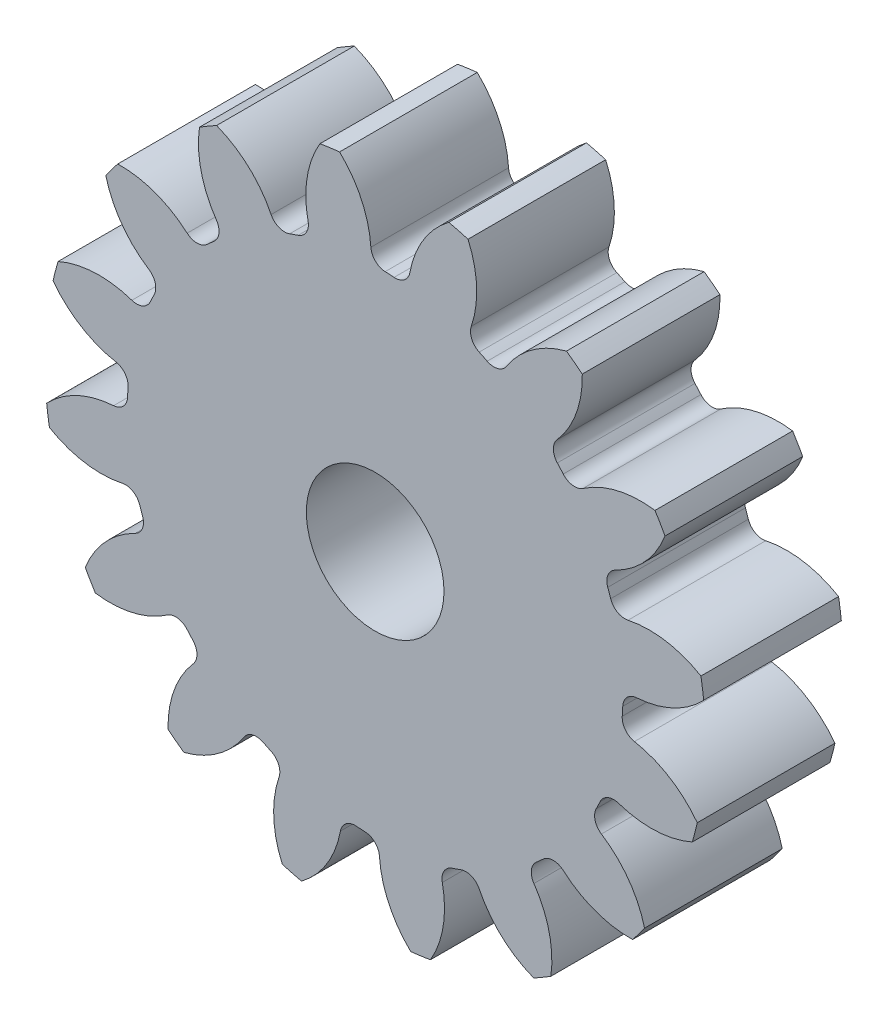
from build123d import *

# Parameters (mm, degrees)
SKETCH3_R         = 304.8
GEARBODY_DEPTH    = 127
TOOTHCUT_DEPTH    = 450.371872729
CIRPATTERN1_COUNT = 16
BOREDIA_R         = 63.5
BORE_DEPTH        = 12700


with BuildPart() as part:
    # Sketch3 → gearBody (new body)
    with BuildSketch(Plane.XY):
        Circle(SKETCH3_R)
    extrude(amount=GEARBODY_DEPTH)

    # Sketch2 → toothCut (cut, through all)
    with BuildSketch(Plane.XY):
        with BuildLine():
            ThreePointArc((227.933335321, -17.445763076), (228.210083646, -13.34607516), (228.413099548, -9.242075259))
            ThreePointArc((228.413099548, -9.242075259), (232.320415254, -0.172804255), (241.291317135, 3.955356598))
            ThreePointArc((241.291317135, 3.955356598), (276.053863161, 13.129673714), (304.8, 34.722781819))
            ThreePointArc((304.8, 34.722781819), (306.248181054, -17.9098626), (298.674779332, -70.014911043))
            ThreePointArc((298.674779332, -70.014911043), (272.641588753, -45.218223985), (239.185413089, -32.054371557))
            ThreePointArc((239.185413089, -32.054371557), (230.756861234, -26.908664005), (227.933335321, -17.445763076))
        make_face()
    toothcut = extrude(amount=TOOTHCUT_DEPTH, mode=Mode.SUBTRACT)

    # CirPattern1: toothCut ×16 about axis
    cirpattern1_axis = Axis((0, 0, 0), (0, 0, 1))
    for i in range(1, CIRPATTERN1_COUNT):
        add(toothcut.rotate(cirpattern1_axis, i * 360 / CIRPATTERN1_COUNT), mode=Mode.SUBTRACT)

    # boreDia → bore (cut, symmetric)
    with BuildSketch(Plane.XY):
        Circle(BOREDIA_R)
    extrude(amount=BORE_DEPTH, both=True, mode=Mode.SUBTRACT)


solid = part.part
